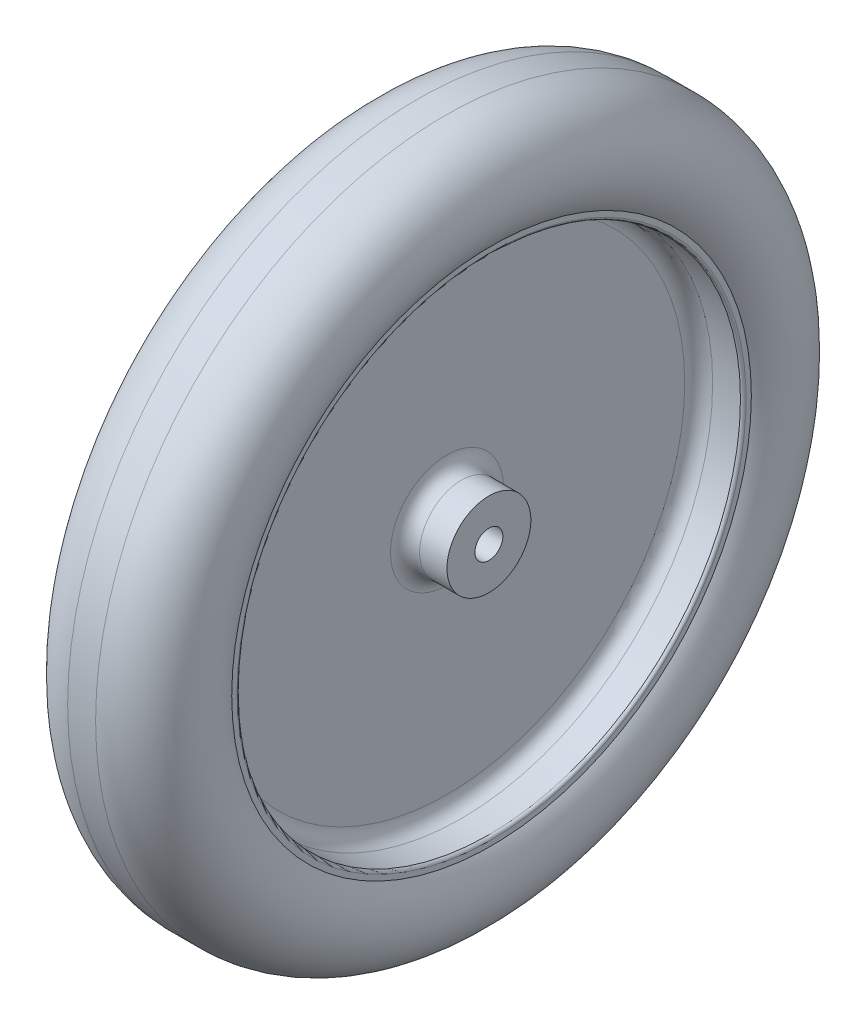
ISO-10303-21;
HEADER;
FILE_DESCRIPTION(('STEP AP214'),'2;1');
FILE_NAME('part.step','',(''),(''),'','','');
FILE_SCHEMA(('AUTOMOTIVE_DESIGN { 1 0 10303 214 1 1 1 1 }'));
ENDSEC;
DATA;
#1=APPLICATION_CONTEXT('core data for automotive mechanical design processes');
#2=APPLICATION_PROTOCOL_DEFINITION('international standard','automotive_design',2000,#1);
#3=PRODUCT_CONTEXT('',#1,'mechanical');
#4=PRODUCT('Part','Part','',(#3));
#5=PRODUCT_RELATED_PRODUCT_CATEGORY('part','',(#4));
#6=PRODUCT_DEFINITION_FORMATION('','',#4);
#7=PRODUCT_DEFINITION_CONTEXT('part definition',#1,'design');
#8=PRODUCT_DEFINITION('design','',#6,#7);
#9=PRODUCT_DEFINITION_SHAPE('','',#8);
#10=(LENGTH_UNIT() NAMED_UNIT(*) SI_UNIT(.MILLI.,.METRE.));
#11=(NAMED_UNIT(*) PLANE_ANGLE_UNIT() SI_UNIT($,.RADIAN.));
#12=(NAMED_UNIT(*) SI_UNIT($,.STERADIAN.) SOLID_ANGLE_UNIT());
#13=UNCERTAINTY_MEASURE_WITH_UNIT(LENGTH_MEASURE(1.E-05),#10,'distance_accuracy_value','');
#14=(GEOMETRIC_REPRESENTATION_CONTEXT(3) GLOBAL_UNCERTAINTY_ASSIGNED_CONTEXT((#13)) GLOBAL_UNIT_ASSIGNED_CONTEXT((#10,
#11,#12)) REPRESENTATION_CONTEXT('',''));
#15=CARTESIAN_POINT('',(0.,0.,0.));
#16=DIRECTION('',(0.,0.,1.));
#17=DIRECTION('',(1.,0.,0.));
#18=AXIS2_PLACEMENT_3D('',#15,#16,#17);
#19=CARTESIAN_POINT('',(21.3562397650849,0.,0.));
#20=DIRECTION('',(-1.,0.,0.));
#21=DIRECTION('',(0.,0.,1.));
#22=AXIS2_PLACEMENT_3D('',#19,#20,#21);
#23=TOROIDAL_SURFACE('',#22,210.022998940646,40.);
#24=CARTESIAN_POINT('',(20.,0.,0.));
#25=DIRECTION('',(-1.,0.,0.));
#26=DIRECTION('',(0.,0.,1.));
#27=AXIS2_PLACEMENT_3D('',#24,#25,#26);
#28=CIRCLE('',#27,250.);
#29=CARTESIAN_POINT('',(20.,0.,250.));
#30=VERTEX_POINT('',#29);
#31=EDGE_CURVE('E96',#30,#30,#28,.T.);
#32=ORIENTED_EDGE('',*,*,#31,.F.);
#33=EDGE_LOOP('',(#32));
#34=FACE_BOUND('',#33,.T.);
#35=CARTESIAN_POINT('',(53.239670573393,0.,0.));
#36=DIRECTION('',(-1.,0.,0.));
#37=DIRECTION('',(0.,0.,1.));
#38=AXIS2_PLACEMENT_3D('',#35,#36,#37);
#39=CIRCLE('',#38,185.868354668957);
#40=CARTESIAN_POINT('',(53.239670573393,0.,185.868354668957));
#41=VERTEX_POINT('',#40);
#42=EDGE_CURVE('E10',#41,#41,#39,.T.);
#43=ORIENTED_EDGE('',*,*,#42,.T.);
#44=EDGE_LOOP('',(#43));
#45=FACE_BOUND('',#44,.T.);
#46=ADVANCED_FACE('F32',(#34,#45),#23,.T.);
#47=CARTESIAN_POINT('',(53.239670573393,182.079406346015,0.));
#48=DIRECTION('',(-1.,0.,0.));
#49=DIRECTION('',(0.,0.,1.));
#50=AXIS2_PLACEMENT_3D('',#47,#48,#49);
#51=PLANE('',#50);
#52=ORIENTED_EDGE('',*,*,#42,.F.);
#53=EDGE_LOOP('',(#52));
#54=FACE_BOUND('',#53,.T.);
#55=CARTESIAN_POINT('',(53.239670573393,0.,0.));
#56=DIRECTION('',(-1.,0.,0.));
#57=DIRECTION('',(0.,0.,1.));
#58=AXIS2_PLACEMENT_3D('',#55,#56,#57);
#59=CIRCLE('',#58,182.079406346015);
#60=CARTESIAN_POINT('',(53.239670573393,0.,182.079406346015));
#61=VERTEX_POINT('',#60);
#62=EDGE_CURVE('E38',#61,#61,#59,.T.);
#63=ORIENTED_EDGE('',*,*,#62,.T.);
#64=EDGE_LOOP('',(#63));
#65=FACE_BOUND('',#64,.T.);
#66=ADVANCED_FACE('F103',(#54,#65),#51,.F.);
#67=CARTESIAN_POINT('',(51.239670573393,0.,0.));
#68=DIRECTION('',(-1.,0.,0.));
#69=DIRECTION('',(0.,0.,1.));
#70=AXIS2_PLACEMENT_3D('',#67,#68,#69);
#71=TOROIDAL_SURFACE('',#70,182.079406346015,2.00000000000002);
#72=ORIENTED_EDGE('',*,*,#62,.F.);
#73=EDGE_LOOP('',(#72));
#74=FACE_BOUND('',#73,.T.);
#75=CARTESIAN_POINT('',(51.239670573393,0.,0.));
#76=DIRECTION('',(-1.,0.,0.));
#77=DIRECTION('',(0.,0.,1.));
#78=AXIS2_PLACEMENT_3D('',#75,#76,#77);
#79=CIRCLE('',#78,180.079406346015);
#80=CARTESIAN_POINT('',(51.239670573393,0.,180.079406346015));
#81=VERTEX_POINT('',#80);
#82=EDGE_CURVE('E42',#81,#81,#79,.T.);
#83=ORIENTED_EDGE('',*,*,#82,.T.);
#84=EDGE_LOOP('',(#83));
#85=FACE_BOUND('',#84,.T.);
#86=ADVANCED_FACE('F107',(#74,#85),#71,.T.);
#87=CARTESIAN_POINT('',(-36.2684599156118,0.,0.));
#88=DIRECTION('',(-1.,0.,0.));
#89=DIRECTION('',(0.,0.,1.));
#90=AXIS2_PLACEMENT_3D('',#87,#88,#89);
#91=CYLINDRICAL_SURFACE('',#90,180.079406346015);
#92=ORIENTED_EDGE('',*,*,#82,.F.);
#93=EDGE_LOOP('',(#92));
#94=FACE_BOUND('',#93,.T.);
#95=CARTESIAN_POINT('',(31.3562397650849,0.,0.));
#96=DIRECTION('',(-1.,0.,0.));
#97=DIRECTION('',(0.,0.,1.));
#98=AXIS2_PLACEMENT_3D('',#95,#96,#97);
#99=CIRCLE('',#98,180.079406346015);
#100=CARTESIAN_POINT('',(31.3562397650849,0.,180.079406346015));
#101=VERTEX_POINT('',#100);
#102=EDGE_CURVE('E46',#101,#101,#99,.T.);
#103=ORIENTED_EDGE('',*,*,#102,.T.);
#104=EDGE_LOOP('',(#103));
#105=FACE_BOUND('',#104,.T.);
#106=ADVANCED_FACE('F112',(#94,#105),#91,.F.);
#107=CARTESIAN_POINT('',(31.3562397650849,0.,0.));
#108=DIRECTION('',(-1.,0.,0.));
#109=DIRECTION('',(0.,0.,1.));
#110=AXIS2_PLACEMENT_3D('',#107,#108,#109);
#111=TOROIDAL_SURFACE('',#110,170.079406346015,10.);
#112=ORIENTED_EDGE('',*,*,#102,.F.);
#113=EDGE_LOOP('',(#112));
#114=FACE_BOUND('',#113,.T.);
#115=CARTESIAN_POINT('',(21.3562397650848,0.,0.));
#116=DIRECTION('',(-1.,0.,0.));
#117=DIRECTION('',(0.,0.,1.));
#118=AXIS2_PLACEMENT_3D('',#115,#116,#117);
#119=CIRCLE('',#118,170.079406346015);
#120=CARTESIAN_POINT('',(21.3562397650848,0.,170.079406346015));
#121=VERTEX_POINT('',#120);
#122=EDGE_CURVE('E51',#121,#121,#119,.T.);
#123=ORIENTED_EDGE('',*,*,#122,.T.);
#124=EDGE_LOOP('',(#123));
#125=FACE_BOUND('',#124,.T.);
#126=ADVANCED_FACE('F118',(#114,#125),#111,.F.);
#127=CARTESIAN_POINT('',(21.3562397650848,40.4006315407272,0.));
#128=DIRECTION('',(-1.,0.,0.));
#129=DIRECTION('',(0.,0.,1.));
#130=AXIS2_PLACEMENT_3D('',#127,#128,#129);
#131=PLANE('',#130);
#132=ORIENTED_EDGE('',*,*,#122,.F.);
#133=EDGE_LOOP('',(#132));
#134=FACE_BOUND('',#133,.T.);
#135=CARTESIAN_POINT('',(21.3562397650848,0.,0.));
#136=DIRECTION('',(-1.,0.,0.));
#137=DIRECTION('',(0.,0.,1.));
#138=AXIS2_PLACEMENT_3D('',#135,#136,#137);
#139=CIRCLE('',#138,40.4006315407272);
#140=CARTESIAN_POINT('',(21.3562397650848,0.,40.4006315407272));
#141=VERTEX_POINT('',#140);
#142=EDGE_CURVE('E54',#141,#141,#139,.T.);
#143=ORIENTED_EDGE('',*,*,#142,.T.);
#144=EDGE_LOOP('',(#143));
#145=FACE_BOUND('',#144,.T.);
#146=ADVANCED_FACE('F122',(#134,#145),#131,.F.);
#147=CARTESIAN_POINT('',(31.756871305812,0.,0.));
#148=DIRECTION('',(-1.,0.,0.));
#149=DIRECTION('',(0.,0.,1.));
#150=AXIS2_PLACEMENT_3D('',#147,#148,#149);
#151=TOROIDAL_SURFACE('',#150,40.4006315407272,10.4006315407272);
#152=ORIENTED_EDGE('',*,*,#142,.F.);
#153=EDGE_LOOP('',(#152));
#154=FACE_BOUND('',#153,.T.);
#155=CARTESIAN_POINT('',(31.756871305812,0.,0.));
#156=DIRECTION('',(-1.,0.,0.));
#157=DIRECTION('',(0.,0.,1.));
#158=AXIS2_PLACEMENT_3D('',#155,#156,#157);
#159=CIRCLE('',#158,30.);
#160=CARTESIAN_POINT('',(31.756871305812,0.,30.));
#161=VERTEX_POINT('',#160);
#162=EDGE_CURVE('E57',#161,#161,#159,.T.);
#163=ORIENTED_EDGE('',*,*,#162,.T.);
#164=EDGE_LOOP('',(#163));
#165=FACE_BOUND('',#164,.T.);
#166=ADVANCED_FACE('F126',(#154,#165),#151,.F.);
#167=CARTESIAN_POINT('',(-36.2684599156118,0.,0.));
#168=DIRECTION('',(-1.,0.,0.));
#169=DIRECTION('',(0.,0.,1.));
#170=AXIS2_PLACEMENT_3D('',#167,#168,#169);
#171=CYLINDRICAL_SURFACE('',#170,30.);
#172=ORIENTED_EDGE('',*,*,#162,.F.);
#173=EDGE_LOOP('',(#172));
#174=FACE_BOUND('',#173,.T.);
#175=CARTESIAN_POINT('',(51.3562397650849,0.,0.));
#176=DIRECTION('',(-1.,0.,0.));
#177=DIRECTION('',(0.,0.,1.));
#178=AXIS2_PLACEMENT_3D('',#175,#176,#177);
#179=CIRCLE('',#178,30.);
#180=CARTESIAN_POINT('',(51.3562397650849,0.,30.));
#181=VERTEX_POINT('',#180);
#182=EDGE_CURVE('E60',#181,#181,#179,.T.);
#183=ORIENTED_EDGE('',*,*,#182,.T.);
#184=EDGE_LOOP('',(#183));
#185=FACE_BOUND('',#184,.T.);
#186=ADVANCED_FACE('F130',(#174,#185),#171,.T.);
#187=CARTESIAN_POINT('',(51.3562397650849,9.99999999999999,0.));
#188=DIRECTION('',(-1.,0.,0.));
#189=DIRECTION('',(0.,0.,1.));
#190=AXIS2_PLACEMENT_3D('',#187,#188,#189);
#191=PLANE('',#190);
#192=ORIENTED_EDGE('',*,*,#182,.F.);
#193=EDGE_LOOP('',(#192));
#194=FACE_BOUND('',#193,.T.);
#195=CARTESIAN_POINT('',(51.3562397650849,0.,0.));
#196=DIRECTION('',(-1.,0.,0.));
#197=DIRECTION('',(0.,0.,1.));
#198=AXIS2_PLACEMENT_3D('',#195,#196,#197);
#199=CIRCLE('',#198,9.99999999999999);
#200=CARTESIAN_POINT('',(51.3562397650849,0.,9.99999999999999));
#201=VERTEX_POINT('',#200);
#202=EDGE_CURVE('E63',#201,#201,#199,.T.);
#203=ORIENTED_EDGE('',*,*,#202,.T.);
#204=EDGE_LOOP('',(#203));
#205=FACE_BOUND('',#204,.T.);
#206=ADVANCED_FACE('F134',(#194,#205),#191,.F.);
#207=CARTESIAN_POINT('',(-36.2684599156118,0.,0.));
#208=DIRECTION('',(-1.,0.,0.));
#209=DIRECTION('',(0.,0.,1.));
#210=AXIS2_PLACEMENT_3D('',#207,#208,#209);
#211=CYLINDRICAL_SURFACE('',#210,9.99999999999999);
#212=ORIENTED_EDGE('',*,*,#202,.F.);
#213=EDGE_LOOP('',(#212));
#214=FACE_BOUND('',#213,.T.);
#215=CARTESIAN_POINT('',(-28.6437602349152,0.,0.));
#216=DIRECTION('',(-1.,0.,0.));
#217=DIRECTION('',(0.,0.,1.));
#218=AXIS2_PLACEMENT_3D('',#215,#216,#217);
#219=CIRCLE('',#218,9.99999999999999);
#220=CARTESIAN_POINT('',(-28.6437602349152,0.,9.99999999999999));
#221=VERTEX_POINT('',#220);
#222=EDGE_CURVE('E66',#221,#221,#219,.T.);
#223=ORIENTED_EDGE('',*,*,#222,.T.);
#224=EDGE_LOOP('',(#223));
#225=FACE_BOUND('',#224,.T.);
#226=ADVANCED_FACE('F138',(#214,#225),#211,.F.);
#227=CARTESIAN_POINT('',(-28.6437602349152,9.99999999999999,0.));
#228=DIRECTION('',(1.,0.,0.));
#229=DIRECTION('',(0.,0.,-1.));
#230=AXIS2_PLACEMENT_3D('',#227,#228,#229);
#231=PLANE('',#230);
#232=ORIENTED_EDGE('',*,*,#222,.F.);
#233=EDGE_LOOP('',(#232));
#234=FACE_BOUND('',#233,.T.);
#235=CARTESIAN_POINT('',(-28.6437602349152,0.,0.));
#236=DIRECTION('',(-1.,0.,0.));
#237=DIRECTION('',(0.,0.,1.));
#238=AXIS2_PLACEMENT_3D('',#235,#236,#237);
#239=CIRCLE('',#238,30.);
#240=CARTESIAN_POINT('',(-28.6437602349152,0.,30.));
#241=VERTEX_POINT('',#240);
#242=EDGE_CURVE('E69',#241,#241,#239,.T.);
#243=ORIENTED_EDGE('',*,*,#242,.T.);
#244=EDGE_LOOP('',(#243));
#245=FACE_BOUND('',#244,.T.);
#246=ADVANCED_FACE('F142',(#234,#245),#231,.F.);
#247=CARTESIAN_POINT('',(-36.2684599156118,0.,0.));
#248=DIRECTION('',(-1.,0.,0.));
#249=DIRECTION('',(0.,0.,1.));
#250=AXIS2_PLACEMENT_3D('',#247,#248,#249);
#251=CYLINDRICAL_SURFACE('',#250,30.);
#252=ORIENTED_EDGE('',*,*,#242,.F.);
#253=EDGE_LOOP('',(#252));
#254=FACE_BOUND('',#253,.T.);
#255=CARTESIAN_POINT('',(-9.95466591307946,0.,0.));
#256=DIRECTION('',(-1.,0.,0.));
#257=DIRECTION('',(0.,0.,1.));
#258=AXIS2_PLACEMENT_3D('',#255,#256,#257);
#259=CIRCLE('',#258,30.);
#260=CARTESIAN_POINT('',(-9.95466591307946,0.,30.));
#261=VERTEX_POINT('',#260);
#262=EDGE_CURVE('E72',#261,#261,#259,.T.);
#263=ORIENTED_EDGE('',*,*,#262,.T.);
#264=EDGE_LOOP('',(#263));
#265=FACE_BOUND('',#264,.T.);
#266=ADVANCED_FACE('F146',(#254,#265),#251,.T.);
#267=CARTESIAN_POINT('',(-9.95466591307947,0.,0.));
#268=DIRECTION('',(-1.,0.,0.));
#269=DIRECTION('',(0.,0.,1.));
#270=AXIS2_PLACEMENT_3D('',#267,#268,#269);
#271=TOROIDAL_SURFACE('',#270,41.3109056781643,11.3109056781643);
#272=ORIENTED_EDGE('',*,*,#262,.F.);
#273=EDGE_LOOP('',(#272));
#274=FACE_BOUND('',#273,.T.);
#275=CARTESIAN_POINT('',(1.35623976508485,0.,0.));
#276=DIRECTION('',(-1.,0.,0.));
#277=DIRECTION('',(0.,0.,1.));
#278=AXIS2_PLACEMENT_3D('',#275,#276,#277);
#279=CIRCLE('',#278,41.3109056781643);
#280=CARTESIAN_POINT('',(1.35623976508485,0.,41.3109056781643));
#281=VERTEX_POINT('',#280);
#282=EDGE_CURVE('E75',#281,#281,#279,.T.);
#283=ORIENTED_EDGE('',*,*,#282,.T.);
#284=EDGE_LOOP('',(#283));
#285=FACE_BOUND('',#284,.T.);
#286=ADVANCED_FACE('F150',(#274,#285),#271,.F.);
#287=CARTESIAN_POINT('',(1.35623976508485,41.3109056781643,0.));
#288=DIRECTION('',(1.,0.,0.));
#289=DIRECTION('',(0.,0.,-1.));
#290=AXIS2_PLACEMENT_3D('',#287,#288,#289);
#291=PLANE('',#290);
#292=ORIENTED_EDGE('',*,*,#282,.F.);
#293=EDGE_LOOP('',(#292));
#294=FACE_BOUND('',#293,.T.);
#295=CARTESIAN_POINT('',(1.35623976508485,0.,0.));
#296=DIRECTION('',(-1.,0.,0.));
#297=DIRECTION('',(0.,0.,1.));
#298=AXIS2_PLACEMENT_3D('',#295,#296,#297);
#299=CIRCLE('',#298,170.079406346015);
#300=CARTESIAN_POINT('',(1.35623976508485,0.,170.079406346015));
#301=VERTEX_POINT('',#300);
#302=EDGE_CURVE('E78',#301,#301,#299,.T.);
#303=ORIENTED_EDGE('',*,*,#302,.T.);
#304=EDGE_LOOP('',(#303));
#305=FACE_BOUND('',#304,.T.);
#306=ADVANCED_FACE('F154',(#294,#305),#291,.F.);
#307=CARTESIAN_POINT('',(-8.64376023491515,0.,0.));
#308=DIRECTION('',(-1.,0.,0.));
#309=DIRECTION('',(0.,0.,1.));
#310=AXIS2_PLACEMENT_3D('',#307,#308,#309);
#311=TOROIDAL_SURFACE('',#310,170.079406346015,10.);
#312=ORIENTED_EDGE('',*,*,#302,.F.);
#313=EDGE_LOOP('',(#312));
#314=FACE_BOUND('',#313,.T.);
#315=CARTESIAN_POINT('',(-8.64376023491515,0.,0.));
#316=DIRECTION('',(-1.,0.,0.));
#317=DIRECTION('',(0.,0.,1.));
#318=AXIS2_PLACEMENT_3D('',#315,#316,#317);
#319=CIRCLE('',#318,180.079406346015);
#320=CARTESIAN_POINT('',(-8.64376023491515,0.,180.079406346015));
#321=VERTEX_POINT('',#320);
#322=EDGE_CURVE('E81',#321,#321,#319,.T.);
#323=ORIENTED_EDGE('',*,*,#322,.T.);
#324=EDGE_LOOP('',(#323));
#325=FACE_BOUND('',#324,.T.);
#326=ADVANCED_FACE('F158',(#314,#325),#311,.F.);
#327=CARTESIAN_POINT('',(-36.2684599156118,0.,0.));
#328=DIRECTION('',(-1.,0.,0.));
#329=DIRECTION('',(0.,0.,1.));
#330=AXIS2_PLACEMENT_3D('',#327,#328,#329);
#331=CYLINDRICAL_SURFACE('',#330,180.079406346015);
#332=ORIENTED_EDGE('',*,*,#322,.F.);
#333=EDGE_LOOP('',(#332));
#334=FACE_BOUND('',#333,.T.);
#335=CARTESIAN_POINT('',(-28.8425175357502,0.,0.));
#336=DIRECTION('',(-1.,0.,0.));
#337=DIRECTION('',(0.,0.,1.));
#338=AXIS2_PLACEMENT_3D('',#335,#336,#337);
#339=CIRCLE('',#338,180.079406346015);
#340=CARTESIAN_POINT('',(-28.8425175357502,0.,180.079406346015));
#341=VERTEX_POINT('',#340);
#342=EDGE_CURVE('E84',#341,#341,#339,.T.);
#343=ORIENTED_EDGE('',*,*,#342,.T.);
#344=EDGE_LOOP('',(#343));
#345=FACE_BOUND('',#344,.T.);
#346=ADVANCED_FACE('F162',(#334,#345),#331,.F.);
#347=CARTESIAN_POINT('',(-28.8425175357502,0.,0.));
#348=DIRECTION('',(-1.,0.,0.));
#349=DIRECTION('',(0.,0.,1.));
#350=AXIS2_PLACEMENT_3D('',#347,#348,#349);
#351=TOROIDAL_SURFACE('',#350,182.079406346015,1.99999999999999);
#352=ORIENTED_EDGE('',*,*,#342,.F.);
#353=EDGE_LOOP('',(#352));
#354=FACE_BOUND('',#353,.T.);
#355=CARTESIAN_POINT('',(-30.8425175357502,0.,0.));
#356=DIRECTION('',(-1.,0.,0.));
#357=DIRECTION('',(0.,0.,1.));
#358=AXIS2_PLACEMENT_3D('',#355,#356,#357);
#359=CIRCLE('',#358,182.079406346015);
#360=CARTESIAN_POINT('',(-30.8425175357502,0.,182.079406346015));
#361=VERTEX_POINT('',#360);
#362=EDGE_CURVE('E87',#361,#361,#359,.T.);
#363=ORIENTED_EDGE('',*,*,#362,.T.);
#364=EDGE_LOOP('',(#363));
#365=FACE_BOUND('',#364,.T.);
#366=ADVANCED_FACE('F166',(#354,#365),#351,.T.);
#367=CARTESIAN_POINT('',(-30.8425175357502,182.079406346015,0.));
#368=DIRECTION('',(1.,0.,0.));
#369=DIRECTION('',(0.,0.,-1.));
#370=AXIS2_PLACEMENT_3D('',#367,#368,#369);
#371=PLANE('',#370);
#372=ORIENTED_EDGE('',*,*,#362,.F.);
#373=EDGE_LOOP('',(#372));
#374=FACE_BOUND('',#373,.T.);
#375=CARTESIAN_POINT('',(-30.8425175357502,0.,0.));
#376=DIRECTION('',(-1.,0.,0.));
#377=DIRECTION('',(0.,0.,1.));
#378=AXIS2_PLACEMENT_3D('',#375,#376,#377);
#379=CIRCLE('',#378,186.290320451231);
#380=CARTESIAN_POINT('',(-30.8425175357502,0.,186.290320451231));
#381=VERTEX_POINT('',#380);
#382=EDGE_CURVE('E90',#381,#381,#379,.T.);
#383=ORIENTED_EDGE('',*,*,#382,.T.);
#384=EDGE_LOOP('',(#383));
#385=FACE_BOUND('',#384,.T.);
#386=ADVANCED_FACE('F170',(#374,#385),#371,.F.);
#387=CARTESIAN_POINT('',(1.35623976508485,0.,0.));
#388=DIRECTION('',(-1.,0.,0.));
#389=DIRECTION('',(0.,0.,1.));
#390=AXIS2_PLACEMENT_3D('',#387,#388,#389);
#391=TOROIDAL_SURFACE('',#390,210.022998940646,40.);
#392=ORIENTED_EDGE('',*,*,#382,.F.);
#393=EDGE_LOOP('',(#392));
#394=FACE_BOUND('',#393,.T.);
#395=CARTESIAN_POINT('',(0.,0.,0.));
#396=DIRECTION('',(-1.,0.,0.));
#397=DIRECTION('',(0.,0.,1.));
#398=AXIS2_PLACEMENT_3D('',#395,#396,#397);
#399=CIRCLE('',#398,250.);
#400=CARTESIAN_POINT('',(0.,0.,250.));
#401=VERTEX_POINT('',#400);
#402=EDGE_CURVE('E93',#401,#401,#399,.T.);
#403=ORIENTED_EDGE('',*,*,#402,.T.);
#404=EDGE_LOOP('',(#403));
#405=FACE_BOUND('',#404,.T.);
#406=ADVANCED_FACE('F174',(#394,#405),#391,.T.);
#407=CARTESIAN_POINT('',(-36.2684599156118,0.,0.));
#408=DIRECTION('',(-1.,0.,0.));
#409=DIRECTION('',(0.,0.,1.));
#410=AXIS2_PLACEMENT_3D('',#407,#408,#409);
#411=CYLINDRICAL_SURFACE('',#410,250.);
#412=ORIENTED_EDGE('',*,*,#402,.F.);
#413=EDGE_LOOP('',(#412));
#414=FACE_BOUND('',#413,.T.);
#415=ORIENTED_EDGE('',*,*,#31,.T.);
#416=EDGE_LOOP('',(#415));
#417=FACE_BOUND('',#416,.T.);
#418=ADVANCED_FACE('F100',(#414,#417),#411,.T.);
#419=CLOSED_SHELL('',(#46,#66,#86,#106,#126,#146,#166,#186,#206,#226,#246,#266,#286,#306,#326,
#346,#366,#386,#406,#418));
#420=MANIFOLD_SOLID_BREP('B2',#419);
#421=ADVANCED_BREP_SHAPE_REPRESENTATION('',(#18,#420),#14);
#422=SHAPE_DEFINITION_REPRESENTATION(#9,#421);
ENDSEC;
END-ISO-10303-21;
